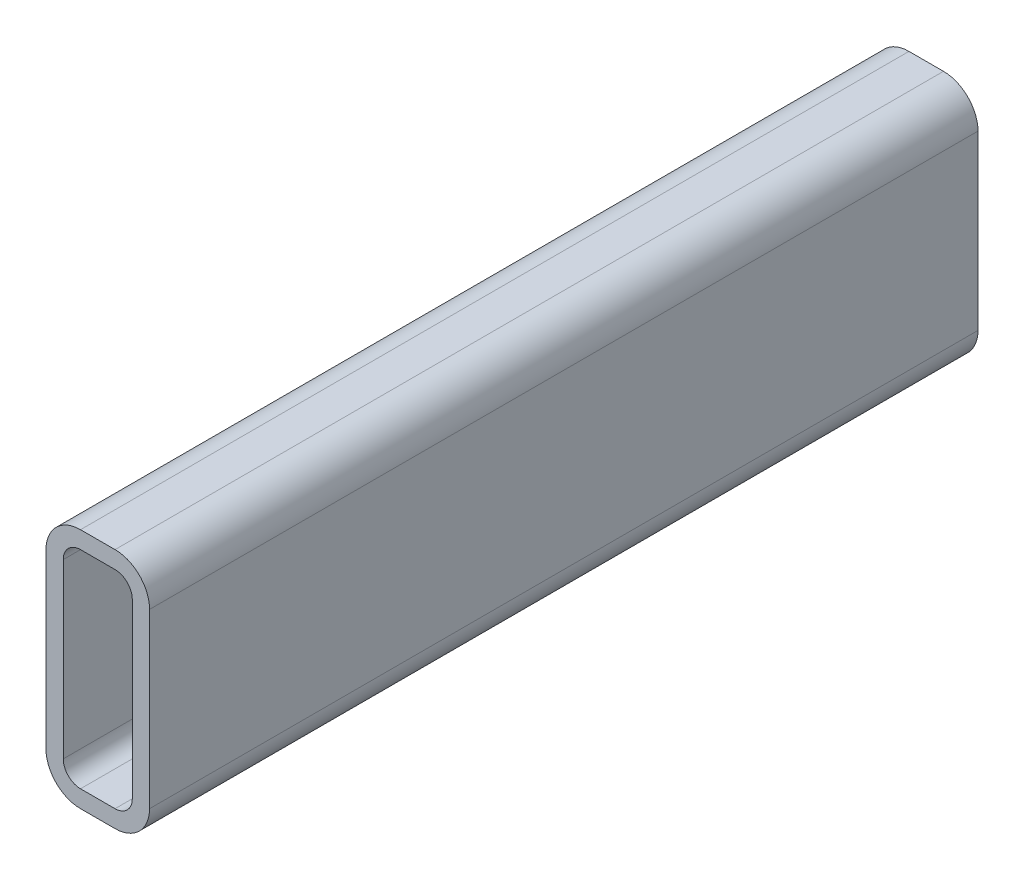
ISO-10303-21;
HEADER;
FILE_DESCRIPTION(('STEP AP214'),'2;1');
FILE_NAME('part.step','',(''),(''),'','','');
FILE_SCHEMA(('AUTOMOTIVE_DESIGN { 1 0 10303 214 1 1 1 1 }'));
ENDSEC;
DATA;
#1=APPLICATION_CONTEXT('core data for automotive mechanical design processes');
#2=APPLICATION_PROTOCOL_DEFINITION('international standard','automotive_design',2000,#1);
#3=PRODUCT_CONTEXT('',#1,'mechanical');
#4=PRODUCT('Part','Part','',(#3));
#5=PRODUCT_RELATED_PRODUCT_CATEGORY('part','',(#4));
#6=PRODUCT_DEFINITION_FORMATION('','',#4);
#7=PRODUCT_DEFINITION_CONTEXT('part definition',#1,'design');
#8=PRODUCT_DEFINITION('design','',#6,#7);
#9=PRODUCT_DEFINITION_SHAPE('','',#8);
#10=(LENGTH_UNIT() NAMED_UNIT(*) SI_UNIT(.MILLI.,.METRE.));
#11=(NAMED_UNIT(*) PLANE_ANGLE_UNIT() SI_UNIT($,.RADIAN.));
#12=(NAMED_UNIT(*) SI_UNIT($,.STERADIAN.) SOLID_ANGLE_UNIT());
#13=UNCERTAINTY_MEASURE_WITH_UNIT(LENGTH_MEASURE(1.E-05),#10,'distance_accuracy_value','');
#14=(GEOMETRIC_REPRESENTATION_CONTEXT(3) GLOBAL_UNCERTAINTY_ASSIGNED_CONTEXT((#13)) GLOBAL_UNIT_ASSIGNED_CONTEXT((#10,
#11,#12)) REPRESENTATION_CONTEXT('',''));
#15=CARTESIAN_POINT('',(0.,0.,0.));
#16=DIRECTION('',(0.,0.,1.));
#17=DIRECTION('',(1.,0.,0.));
#18=AXIS2_PLACEMENT_3D('',#15,#16,#17);
#19=CARTESIAN_POINT('',(12.7,76.2,304.8));
#20=DIRECTION('',(0.,0.,1.));
#21=DIRECTION('',(1.,0.,0.));
#22=AXIS2_PLACEMENT_3D('',#19,#20,#21);
#23=PLANE('',#22);
#24=CARTESIAN_POINT('',(12.7,76.2,304.8));
#25=DIRECTION('',(0.,0.,1.));
#26=DIRECTION('',(1.,0.,0.));
#27=AXIS2_PLACEMENT_3D('',#24,#25,#26);
#28=CIRCLE('',#27,12.7);
#29=CARTESIAN_POINT('',(12.7,88.9,304.8));
#30=VERTEX_POINT('',#29);
#31=CARTESIAN_POINT('',(0.,76.2,304.8));
#32=VERTEX_POINT('',#31);
#33=EDGE_CURVE('E211',#30,#32,#28,.T.);
#34=ORIENTED_EDGE('',*,*,#33,.T.);
#35=DIRECTION('',(0.,-1.,0.));
#36=VECTOR('',#35,1.);
#37=CARTESIAN_POINT('',(0.,12.7,304.8));
#38=LINE('',#37,#36);
#39=CARTESIAN_POINT('',(0.,12.7,304.8));
#40=VERTEX_POINT('',#39);
#41=EDGE_CURVE('E214',#32,#40,#38,.T.);
#42=ORIENTED_EDGE('',*,*,#41,.T.);
#43=CARTESIAN_POINT('',(12.7,12.7,304.8));
#44=DIRECTION('',(0.,0.,1.));
#45=DIRECTION('',(1.,0.,0.));
#46=AXIS2_PLACEMENT_3D('',#43,#44,#45);
#47=CIRCLE('',#46,12.7);
#48=CARTESIAN_POINT('',(12.7,0.,304.8));
#49=VERTEX_POINT('',#48);
#50=EDGE_CURVE('E217',#40,#49,#47,.T.);
#51=ORIENTED_EDGE('',*,*,#50,.T.);
#52=DIRECTION('',(1.,0.,0.));
#53=VECTOR('',#52,1.);
#54=CARTESIAN_POINT('',(25.4,0.,304.8));
#55=LINE('',#54,#53);
#56=CARTESIAN_POINT('',(25.4,0.,304.8));
#57=VERTEX_POINT('',#56);
#58=EDGE_CURVE('E219',#49,#57,#55,.T.);
#59=ORIENTED_EDGE('',*,*,#58,.T.);
#60=CARTESIAN_POINT('',(25.4,12.7,304.8));
#61=DIRECTION('',(0.,0.,1.));
#62=DIRECTION('',(1.,0.,0.));
#63=AXIS2_PLACEMENT_3D('',#60,#61,#62);
#64=CIRCLE('',#63,12.7);
#65=CARTESIAN_POINT('',(38.1,12.7,304.8));
#66=VERTEX_POINT('',#65);
#67=EDGE_CURVE('E221',#57,#66,#64,.T.);
#68=ORIENTED_EDGE('',*,*,#67,.T.);
#69=DIRECTION('',(0.,1.,0.));
#70=VECTOR('',#69,1.);
#71=CARTESIAN_POINT('',(38.1,76.2,304.8));
#72=LINE('',#71,#70);
#73=CARTESIAN_POINT('',(38.1,76.2,304.8));
#74=VERTEX_POINT('',#73);
#75=EDGE_CURVE('E223',#66,#74,#72,.T.);
#76=ORIENTED_EDGE('',*,*,#75,.T.);
#77=CARTESIAN_POINT('',(25.4,76.2,304.8));
#78=DIRECTION('',(0.,0.,1.));
#79=DIRECTION('',(1.,0.,0.));
#80=AXIS2_PLACEMENT_3D('',#77,#78,#79);
#81=CIRCLE('',#80,12.7);
#82=CARTESIAN_POINT('',(25.4,88.9,304.8));
#83=VERTEX_POINT('',#82);
#84=EDGE_CURVE('E225',#74,#83,#81,.T.);
#85=ORIENTED_EDGE('',*,*,#84,.T.);
#86=DIRECTION('',(-1.,0.,0.));
#87=VECTOR('',#86,1.);
#88=CARTESIAN_POINT('',(12.7,88.9,304.8));
#89=LINE('',#88,#87);
#90=EDGE_CURVE('E227',#83,#30,#89,.T.);
#91=ORIENTED_EDGE('',*,*,#90,.T.);
#92=EDGE_LOOP('',(#34,#42,#51,#59,#68,#76,#85,#91));
#93=FACE_BOUND('',#92,.T.);
#94=DIRECTION('',(0.,-1.,0.));
#95=VECTOR('',#94,1.);
#96=CARTESIAN_POINT('',(6.35,12.7,304.8));
#97=LINE('',#96,#95);
#98=CARTESIAN_POINT('',(6.35,76.2,304.8));
#99=VERTEX_POINT('',#98);
#100=CARTESIAN_POINT('',(6.35,12.7,304.8));
#101=VERTEX_POINT('',#100);
#102=EDGE_CURVE('E154',#99,#101,#97,.T.);
#103=ORIENTED_EDGE('',*,*,#102,.F.);
#104=CARTESIAN_POINT('',(12.7,76.2,304.8));
#105=DIRECTION('',(0.,0.,1.));
#106=DIRECTION('',(1.,0.,0.));
#107=AXIS2_PLACEMENT_3D('',#104,#105,#106);
#108=CIRCLE('',#107,6.35);
#109=CARTESIAN_POINT('',(12.7,82.55,304.8));
#110=VERTEX_POINT('',#109);
#111=EDGE_CURVE('E146',#110,#99,#108,.T.);
#112=ORIENTED_EDGE('',*,*,#111,.F.);
#113=DIRECTION('',(-1.,0.,0.));
#114=VECTOR('',#113,1.);
#115=CARTESIAN_POINT('',(12.7,82.55,304.8));
#116=LINE('',#115,#114);
#117=CARTESIAN_POINT('',(25.4,82.55,304.8));
#118=VERTEX_POINT('',#117);
#119=EDGE_CURVE('E179',#118,#110,#116,.T.);
#120=ORIENTED_EDGE('',*,*,#119,.F.);
#121=CARTESIAN_POINT('',(25.4,76.2,304.8));
#122=DIRECTION('',(0.,0.,1.));
#123=DIRECTION('',(1.,0.,0.));
#124=AXIS2_PLACEMENT_3D('',#121,#122,#123);
#125=CIRCLE('',#124,6.35);
#126=CARTESIAN_POINT('',(31.75,76.2,304.8));
#127=VERTEX_POINT('',#126);
#128=EDGE_CURVE('E177',#127,#118,#125,.T.);
#129=ORIENTED_EDGE('',*,*,#128,.F.);
#130=DIRECTION('',(0.,1.,0.));
#131=VECTOR('',#130,1.);
#132=CARTESIAN_POINT('',(31.75,76.2,304.8));
#133=LINE('',#132,#131);
#134=CARTESIAN_POINT('',(31.75,12.7,304.8));
#135=VERTEX_POINT('',#134);
#136=EDGE_CURVE('E175',#135,#127,#133,.T.);
#137=ORIENTED_EDGE('',*,*,#136,.F.);
#138=CARTESIAN_POINT('',(25.4,12.7,304.8));
#139=DIRECTION('',(0.,0.,1.));
#140=DIRECTION('',(1.,0.,0.));
#141=AXIS2_PLACEMENT_3D('',#138,#139,#140);
#142=CIRCLE('',#141,6.35);
#143=CARTESIAN_POINT('',(25.4,6.35000000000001,304.8));
#144=VERTEX_POINT('',#143);
#145=EDGE_CURVE('E173',#144,#135,#142,.T.);
#146=ORIENTED_EDGE('',*,*,#145,.F.);
#147=DIRECTION('',(1.,0.,0.));
#148=VECTOR('',#147,1.);
#149=CARTESIAN_POINT('',(25.4,6.35000000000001,304.8));
#150=LINE('',#149,#148);
#151=CARTESIAN_POINT('',(12.7,6.35000000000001,304.8));
#152=VERTEX_POINT('',#151);
#153=EDGE_CURVE('E169',#152,#144,#150,.T.);
#154=ORIENTED_EDGE('',*,*,#153,.F.);
#155=CARTESIAN_POINT('',(12.7,12.7,304.8));
#156=DIRECTION('',(0.,0.,1.));
#157=DIRECTION('',(1.,0.,0.));
#158=AXIS2_PLACEMENT_3D('',#155,#156,#157);
#159=CIRCLE('',#158,6.35);
#160=EDGE_CURVE('E167',#101,#152,#159,.T.);
#161=ORIENTED_EDGE('',*,*,#160,.F.);
#162=EDGE_LOOP('',(#103,#112,#120,#129,#137,#146,#154,#161));
#163=FACE_BOUND('',#162,.T.);
#164=ADVANCED_FACE('F33',(#93,#163),#23,.T.);
#165=CARTESIAN_POINT('',(12.7,76.2,0.));
#166=DIRECTION('',(0.,0.,1.));
#167=DIRECTION('',(1.,0.,0.));
#168=AXIS2_PLACEMENT_3D('',#165,#166,#167);
#169=PLANE('',#168);
#170=CARTESIAN_POINT('',(12.7,76.2,0.));
#171=DIRECTION('',(0.,0.,1.));
#172=DIRECTION('',(1.,0.,0.));
#173=AXIS2_PLACEMENT_3D('',#170,#171,#172);
#174=CIRCLE('',#173,12.7);
#175=CARTESIAN_POINT('',(12.7,88.9,0.));
#176=VERTEX_POINT('',#175);
#177=CARTESIAN_POINT('',(0.,76.2,0.));
#178=VERTEX_POINT('',#177);
#179=EDGE_CURVE('E162',#176,#178,#174,.T.);
#180=ORIENTED_EDGE('',*,*,#179,.F.);
#181=DIRECTION('',(-1.,0.,0.));
#182=VECTOR('',#181,1.);
#183=CARTESIAN_POINT('',(12.7,88.9,0.));
#184=LINE('',#183,#182);
#185=CARTESIAN_POINT('',(25.4,88.9,0.));
#186=VERTEX_POINT('',#185);
#187=EDGE_CURVE('E215',#186,#176,#184,.T.);
#188=ORIENTED_EDGE('',*,*,#187,.F.);
#189=CARTESIAN_POINT('',(25.4,76.2,0.));
#190=DIRECTION('',(0.,0.,1.));
#191=DIRECTION('',(1.,0.,0.));
#192=AXIS2_PLACEMENT_3D('',#189,#190,#191);
#193=CIRCLE('',#192,12.7);
#194=CARTESIAN_POINT('',(38.1,76.2,0.));
#195=VERTEX_POINT('',#194);
#196=EDGE_CURVE('E242',#195,#186,#193,.T.);
#197=ORIENTED_EDGE('',*,*,#196,.F.);
#198=DIRECTION('',(0.,1.,0.));
#199=VECTOR('',#198,1.);
#200=CARTESIAN_POINT('',(38.1,76.2,0.));
#201=LINE('',#200,#199);
#202=CARTESIAN_POINT('',(38.1,12.7,0.));
#203=VERTEX_POINT('',#202);
#204=EDGE_CURVE('E240',#203,#195,#201,.T.);
#205=ORIENTED_EDGE('',*,*,#204,.F.);
#206=CARTESIAN_POINT('',(25.4,12.7,0.));
#207=DIRECTION('',(0.,0.,1.));
#208=DIRECTION('',(1.,0.,0.));
#209=AXIS2_PLACEMENT_3D('',#206,#207,#208);
#210=CIRCLE('',#209,12.7);
#211=CARTESIAN_POINT('',(25.4,0.,0.));
#212=VERTEX_POINT('',#211);
#213=EDGE_CURVE('E238',#212,#203,#210,.T.);
#214=ORIENTED_EDGE('',*,*,#213,.F.);
#215=DIRECTION('',(1.,0.,0.));
#216=VECTOR('',#215,1.);
#217=CARTESIAN_POINT('',(25.4,0.,0.));
#218=LINE('',#217,#216);
#219=CARTESIAN_POINT('',(12.7,0.,0.));
#220=VERTEX_POINT('',#219);
#221=EDGE_CURVE('E236',#220,#212,#218,.T.);
#222=ORIENTED_EDGE('',*,*,#221,.F.);
#223=CARTESIAN_POINT('',(12.7,12.7,0.));
#224=DIRECTION('',(0.,0.,1.));
#225=DIRECTION('',(1.,0.,0.));
#226=AXIS2_PLACEMENT_3D('',#223,#224,#225);
#227=CIRCLE('',#226,12.7);
#228=CARTESIAN_POINT('',(0.,12.7,0.));
#229=VERTEX_POINT('',#228);
#230=EDGE_CURVE('E234',#229,#220,#227,.T.);
#231=ORIENTED_EDGE('',*,*,#230,.F.);
#232=DIRECTION('',(0.,-1.,0.));
#233=VECTOR('',#232,1.);
#234=CARTESIAN_POINT('',(0.,12.7,0.));
#235=LINE('',#234,#233);
#236=EDGE_CURVE('E232',#178,#229,#235,.T.);
#237=ORIENTED_EDGE('',*,*,#236,.F.);
#238=EDGE_LOOP('',(#180,#188,#197,#205,#214,#222,#231,#237));
#239=FACE_BOUND('',#238,.T.);
#240=CARTESIAN_POINT('',(12.7,76.2,0.));
#241=DIRECTION('',(0.,0.,1.));
#242=DIRECTION('',(1.,0.,0.));
#243=AXIS2_PLACEMENT_3D('',#240,#241,#242);
#244=CIRCLE('',#243,6.35);
#245=CARTESIAN_POINT('',(12.7,82.55,0.));
#246=VERTEX_POINT('',#245);
#247=CARTESIAN_POINT('',(6.35,76.2,0.));
#248=VERTEX_POINT('',#247);
#249=EDGE_CURVE('E56',#246,#248,#244,.T.);
#250=ORIENTED_EDGE('',*,*,#249,.T.);
#251=DIRECTION('',(0.,-1.,0.));
#252=VECTOR('',#251,1.);
#253=CARTESIAN_POINT('',(6.35,12.7,0.));
#254=LINE('',#253,#252);
#255=CARTESIAN_POINT('',(6.35,12.7,0.));
#256=VERTEX_POINT('',#255);
#257=EDGE_CURVE('E161',#248,#256,#254,.T.);
#258=ORIENTED_EDGE('',*,*,#257,.T.);
#259=CARTESIAN_POINT('',(12.7,12.7,0.));
#260=DIRECTION('',(0.,0.,1.));
#261=DIRECTION('',(1.,0.,0.));
#262=AXIS2_PLACEMENT_3D('',#259,#260,#261);
#263=CIRCLE('',#262,6.35);
#264=CARTESIAN_POINT('',(12.7,6.35000000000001,0.));
#265=VERTEX_POINT('',#264);
#266=EDGE_CURVE('E183',#256,#265,#263,.T.);
#267=ORIENTED_EDGE('',*,*,#266,.T.);
#268=DIRECTION('',(1.,0.,0.));
#269=VECTOR('',#268,1.);
#270=CARTESIAN_POINT('',(25.4,6.35000000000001,0.));
#271=LINE('',#270,#269);
#272=CARTESIAN_POINT('',(25.4,6.35000000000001,0.));
#273=VERTEX_POINT('',#272);
#274=EDGE_CURVE('E186',#265,#273,#271,.T.);
#275=ORIENTED_EDGE('',*,*,#274,.T.);
#276=CARTESIAN_POINT('',(25.4,12.7,0.));
#277=DIRECTION('',(0.,0.,1.));
#278=DIRECTION('',(1.,0.,0.));
#279=AXIS2_PLACEMENT_3D('',#276,#277,#278);
#280=CIRCLE('',#279,6.35);
#281=CARTESIAN_POINT('',(31.75,12.7,0.));
#282=VERTEX_POINT('',#281);
#283=EDGE_CURVE('E189',#273,#282,#280,.T.);
#284=ORIENTED_EDGE('',*,*,#283,.T.);
#285=DIRECTION('',(0.,1.,0.));
#286=VECTOR('',#285,1.);
#287=CARTESIAN_POINT('',(31.75,76.2,0.));
#288=LINE('',#287,#286);
#289=CARTESIAN_POINT('',(31.75,76.2,0.));
#290=VERTEX_POINT('',#289);
#291=EDGE_CURVE('E192',#282,#290,#288,.T.);
#292=ORIENTED_EDGE('',*,*,#291,.T.);
#293=CARTESIAN_POINT('',(25.4,76.2,0.));
#294=DIRECTION('',(0.,0.,1.));
#295=DIRECTION('',(1.,0.,0.));
#296=AXIS2_PLACEMENT_3D('',#293,#294,#295);
#297=CIRCLE('',#296,6.35);
#298=CARTESIAN_POINT('',(25.4,82.55,0.));
#299=VERTEX_POINT('',#298);
#300=EDGE_CURVE('E195',#290,#299,#297,.T.);
#301=ORIENTED_EDGE('',*,*,#300,.T.);
#302=DIRECTION('',(-1.,0.,0.));
#303=VECTOR('',#302,1.);
#304=CARTESIAN_POINT('',(12.7,82.55,0.));
#305=LINE('',#304,#303);
#306=EDGE_CURVE('E155',#299,#246,#305,.T.);
#307=ORIENTED_EDGE('',*,*,#306,.T.);
#308=EDGE_LOOP('',(#250,#258,#267,#275,#284,#292,#301,#307));
#309=FACE_BOUND('',#308,.T.);
#310=ADVANCED_FACE('F272',(#239,#309),#169,.F.);
#311=CARTESIAN_POINT('',(12.7,76.2,304.8));
#312=DIRECTION('',(0.,0.,-1.));
#313=DIRECTION('',(-1.,0.,0.));
#314=AXIS2_PLACEMENT_3D('',#311,#312,#313);
#315=CYLINDRICAL_SURFACE('',#314,12.7);
#316=ORIENTED_EDGE('',*,*,#179,.T.);
#317=DIRECTION('',(0.,0.,-1.));
#318=VECTOR('',#317,1.);
#319=CARTESIAN_POINT('',(0.,76.2,304.8));
#320=LINE('',#319,#318);
#321=EDGE_CURVE('E11',#32,#178,#320,.T.);
#322=ORIENTED_EDGE('',*,*,#321,.F.);
#323=ORIENTED_EDGE('',*,*,#33,.F.);
#324=DIRECTION('',(0.,0.,-1.));
#325=VECTOR('',#324,1.);
#326=CARTESIAN_POINT('',(12.7,88.9,304.8));
#327=LINE('',#326,#325);
#328=EDGE_CURVE('E229',#30,#176,#327,.T.);
#329=ORIENTED_EDGE('',*,*,#328,.T.);
#330=EDGE_LOOP('',(#316,#322,#323,#329));
#331=FACE_BOUND('',#330,.T.);
#332=ADVANCED_FACE('F35',(#331),#315,.T.);
#333=CARTESIAN_POINT('',(0.,12.7,304.8));
#334=DIRECTION('',(1.,0.,0.));
#335=DIRECTION('',(0.,0.,-1.));
#336=AXIS2_PLACEMENT_3D('',#333,#334,#335);
#337=PLANE('',#336);
#338=ORIENTED_EDGE('',*,*,#236,.T.);
#339=DIRECTION('',(0.,0.,-1.));
#340=VECTOR('',#339,1.);
#341=CARTESIAN_POINT('',(0.,12.7,304.8));
#342=LINE('',#341,#340);
#343=EDGE_CURVE('E41',#40,#229,#342,.T.);
#344=ORIENTED_EDGE('',*,*,#343,.F.);
#345=ORIENTED_EDGE('',*,*,#41,.F.);
#346=ORIENTED_EDGE('',*,*,#321,.T.);
#347=EDGE_LOOP('',(#338,#344,#345,#346));
#348=FACE_BOUND('',#347,.T.);
#349=ADVANCED_FACE('F289',(#348),#337,.F.);
#350=CARTESIAN_POINT('',(12.7,12.7,304.8));
#351=DIRECTION('',(0.,0.,-1.));
#352=DIRECTION('',(-1.,0.,0.));
#353=AXIS2_PLACEMENT_3D('',#350,#351,#352);
#354=CYLINDRICAL_SURFACE('',#353,12.7);
#355=ORIENTED_EDGE('',*,*,#230,.T.);
#356=DIRECTION('',(0.,0.,-1.));
#357=VECTOR('',#356,1.);
#358=CARTESIAN_POINT('',(12.7,0.,304.8));
#359=LINE('',#358,#357);
#360=EDGE_CURVE('E259',#49,#220,#359,.T.);
#361=ORIENTED_EDGE('',*,*,#360,.F.);
#362=ORIENTED_EDGE('',*,*,#50,.F.);
#363=ORIENTED_EDGE('',*,*,#343,.T.);
#364=EDGE_LOOP('',(#355,#361,#362,#363));
#365=FACE_BOUND('',#364,.T.);
#366=ADVANCED_FACE('F266',(#365),#354,.T.);
#367=CARTESIAN_POINT('',(25.4,0.,304.8));
#368=DIRECTION('',(0.,1.,0.));
#369=DIRECTION('',(0.,0.,1.));
#370=AXIS2_PLACEMENT_3D('',#367,#368,#369);
#371=PLANE('',#370);
#372=ORIENTED_EDGE('',*,*,#221,.T.);
#373=DIRECTION('',(0.,0.,-1.));
#374=VECTOR('',#373,1.);
#375=CARTESIAN_POINT('',(25.4,0.,304.8));
#376=LINE('',#375,#374);
#377=EDGE_CURVE('E256',#57,#212,#376,.T.);
#378=ORIENTED_EDGE('',*,*,#377,.F.);
#379=ORIENTED_EDGE('',*,*,#58,.F.);
#380=ORIENTED_EDGE('',*,*,#360,.T.);
#381=EDGE_LOOP('',(#372,#378,#379,#380));
#382=FACE_BOUND('',#381,.T.);
#383=ADVANCED_FACE('F278',(#382),#371,.F.);
#384=CARTESIAN_POINT('',(25.4,12.7,304.8));
#385=DIRECTION('',(0.,0.,-1.));
#386=DIRECTION('',(-1.,0.,0.));
#387=AXIS2_PLACEMENT_3D('',#384,#385,#386);
#388=CYLINDRICAL_SURFACE('',#387,12.7);
#389=ORIENTED_EDGE('',*,*,#213,.T.);
#390=DIRECTION('',(0.,0.,-1.));
#391=VECTOR('',#390,1.);
#392=CARTESIAN_POINT('',(38.1,12.7,304.8));
#393=LINE('',#392,#391);
#394=EDGE_CURVE('E253',#66,#203,#393,.T.);
#395=ORIENTED_EDGE('',*,*,#394,.F.);
#396=ORIENTED_EDGE('',*,*,#67,.F.);
#397=ORIENTED_EDGE('',*,*,#377,.T.);
#398=EDGE_LOOP('',(#389,#395,#396,#397));
#399=FACE_BOUND('',#398,.T.);
#400=ADVANCED_FACE('F282',(#399),#388,.T.);
#401=CARTESIAN_POINT('',(38.1,76.2,304.8));
#402=DIRECTION('',(-1.,0.,0.));
#403=DIRECTION('',(0.,0.,1.));
#404=AXIS2_PLACEMENT_3D('',#401,#402,#403);
#405=PLANE('',#404);
#406=ORIENTED_EDGE('',*,*,#204,.T.);
#407=DIRECTION('',(0.,0.,-1.));
#408=VECTOR('',#407,1.);
#409=CARTESIAN_POINT('',(38.1,76.2,304.8));
#410=LINE('',#409,#408);
#411=EDGE_CURVE('E250',#74,#195,#410,.T.);
#412=ORIENTED_EDGE('',*,*,#411,.F.);
#413=ORIENTED_EDGE('',*,*,#75,.F.);
#414=ORIENTED_EDGE('',*,*,#394,.T.);
#415=EDGE_LOOP('',(#406,#412,#413,#414));
#416=FACE_BOUND('',#415,.T.);
#417=ADVANCED_FACE('F302',(#416),#405,.F.);
#418=CARTESIAN_POINT('',(25.4,76.2,304.8));
#419=DIRECTION('',(0.,0.,-1.));
#420=DIRECTION('',(-1.,0.,0.));
#421=AXIS2_PLACEMENT_3D('',#418,#419,#420);
#422=CYLINDRICAL_SURFACE('',#421,12.7);
#423=ORIENTED_EDGE('',*,*,#196,.T.);
#424=DIRECTION('',(0.,0.,-1.));
#425=VECTOR('',#424,1.);
#426=CARTESIAN_POINT('',(25.4,88.9,304.8));
#427=LINE('',#426,#425);
#428=EDGE_CURVE('E247',#83,#186,#427,.T.);
#429=ORIENTED_EDGE('',*,*,#428,.F.);
#430=ORIENTED_EDGE('',*,*,#84,.F.);
#431=ORIENTED_EDGE('',*,*,#411,.T.);
#432=EDGE_LOOP('',(#423,#429,#430,#431));
#433=FACE_BOUND('',#432,.T.);
#434=ADVANCED_FACE('F300',(#433),#422,.T.);
#435=CARTESIAN_POINT('',(12.7,88.9,304.8));
#436=DIRECTION('',(0.,-1.,0.));
#437=DIRECTION('',(0.,0.,-1.));
#438=AXIS2_PLACEMENT_3D('',#435,#436,#437);
#439=PLANE('',#438);
#440=ORIENTED_EDGE('',*,*,#187,.T.);
#441=ORIENTED_EDGE('',*,*,#328,.F.);
#442=ORIENTED_EDGE('',*,*,#90,.F.);
#443=ORIENTED_EDGE('',*,*,#428,.T.);
#444=EDGE_LOOP('',(#440,#441,#442,#443));
#445=FACE_BOUND('',#444,.T.);
#446=ADVANCED_FACE('F295',(#445),#439,.F.);
#447=CARTESIAN_POINT('',(12.7,76.2,304.8));
#448=DIRECTION('',(0.,0.,-1.));
#449=DIRECTION('',(-1.,0.,0.));
#450=AXIS2_PLACEMENT_3D('',#447,#448,#449);
#451=CYLINDRICAL_SURFACE('',#450,6.35);
#452=ORIENTED_EDGE('',*,*,#249,.F.);
#453=DIRECTION('',(0.,0.,-1.));
#454=VECTOR('',#453,1.);
#455=CARTESIAN_POINT('',(12.7,82.55,304.8));
#456=LINE('',#455,#454);
#457=EDGE_CURVE('E150',#110,#246,#456,.T.);
#458=ORIENTED_EDGE('',*,*,#457,.F.);
#459=ORIENTED_EDGE('',*,*,#111,.T.);
#460=DIRECTION('',(0.,0.,-1.));
#461=VECTOR('',#460,1.);
#462=CARTESIAN_POINT('',(6.35,76.2,304.8));
#463=LINE('',#462,#461);
#464=EDGE_CURVE('E149',#99,#248,#463,.T.);
#465=ORIENTED_EDGE('',*,*,#464,.T.);
#466=EDGE_LOOP('',(#452,#458,#459,#465));
#467=FACE_BOUND('',#466,.T.);
#468=ADVANCED_FACE('F148',(#467),#451,.F.);
#469=CARTESIAN_POINT('',(6.35,12.7,304.8));
#470=DIRECTION('',(1.,0.,0.));
#471=DIRECTION('',(0.,0.,-1.));
#472=AXIS2_PLACEMENT_3D('',#469,#470,#471);
#473=PLANE('',#472);
#474=ORIENTED_EDGE('',*,*,#257,.F.);
#475=ORIENTED_EDGE('',*,*,#464,.F.);
#476=ORIENTED_EDGE('',*,*,#102,.T.);
#477=DIRECTION('',(0.,0.,-1.));
#478=VECTOR('',#477,1.);
#479=CARTESIAN_POINT('',(6.35,12.7,304.8));
#480=LINE('',#479,#478);
#481=EDGE_CURVE('E163',#101,#256,#480,.T.);
#482=ORIENTED_EDGE('',*,*,#481,.T.);
#483=EDGE_LOOP('',(#474,#475,#476,#482));
#484=FACE_BOUND('',#483,.T.);
#485=ADVANCED_FACE('F158',(#484),#473,.T.);
#486=CARTESIAN_POINT('',(12.7,12.7,304.8));
#487=DIRECTION('',(0.,0.,-1.));
#488=DIRECTION('',(-1.,0.,0.));
#489=AXIS2_PLACEMENT_3D('',#486,#487,#488);
#490=CYLINDRICAL_SURFACE('',#489,6.35);
#491=ORIENTED_EDGE('',*,*,#266,.F.);
#492=ORIENTED_EDGE('',*,*,#481,.F.);
#493=ORIENTED_EDGE('',*,*,#160,.T.);
#494=DIRECTION('',(0.,0.,-1.));
#495=VECTOR('',#494,1.);
#496=CARTESIAN_POINT('',(12.7,6.35000000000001,304.8));
#497=LINE('',#496,#495);
#498=EDGE_CURVE('E208',#152,#265,#497,.T.);
#499=ORIENTED_EDGE('',*,*,#498,.T.);
#500=EDGE_LOOP('',(#491,#492,#493,#499));
#501=FACE_BOUND('',#500,.T.);
#502=ADVANCED_FACE('F327',(#501),#490,.F.);
#503=CARTESIAN_POINT('',(25.4,6.35000000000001,304.8));
#504=DIRECTION('',(0.,1.,0.));
#505=DIRECTION('',(0.,0.,1.));
#506=AXIS2_PLACEMENT_3D('',#503,#504,#505);
#507=PLANE('',#506);
#508=ORIENTED_EDGE('',*,*,#274,.F.);
#509=ORIENTED_EDGE('',*,*,#498,.F.);
#510=ORIENTED_EDGE('',*,*,#153,.T.);
#511=DIRECTION('',(0.,0.,-1.));
#512=VECTOR('',#511,1.);
#513=CARTESIAN_POINT('',(25.4,6.35000000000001,304.8));
#514=LINE('',#513,#512);
#515=EDGE_CURVE('E206',#144,#273,#514,.T.);
#516=ORIENTED_EDGE('',*,*,#515,.T.);
#517=EDGE_LOOP('',(#508,#509,#510,#516));
#518=FACE_BOUND('',#517,.T.);
#519=ADVANCED_FACE('F331',(#518),#507,.T.);
#520=CARTESIAN_POINT('',(25.4,12.7,304.8));
#521=DIRECTION('',(0.,0.,-1.));
#522=DIRECTION('',(-1.,0.,0.));
#523=AXIS2_PLACEMENT_3D('',#520,#521,#522);
#524=CYLINDRICAL_SURFACE('',#523,6.35);
#525=ORIENTED_EDGE('',*,*,#283,.F.);
#526=ORIENTED_EDGE('',*,*,#515,.F.);
#527=ORIENTED_EDGE('',*,*,#145,.T.);
#528=DIRECTION('',(0.,0.,-1.));
#529=VECTOR('',#528,1.);
#530=CARTESIAN_POINT('',(31.75,12.7,304.8));
#531=LINE('',#530,#529);
#532=EDGE_CURVE('E204',#135,#282,#531,.T.);
#533=ORIENTED_EDGE('',*,*,#532,.T.);
#534=EDGE_LOOP('',(#525,#526,#527,#533));
#535=FACE_BOUND('',#534,.T.);
#536=ADVANCED_FACE('F337',(#535),#524,.F.);
#537=CARTESIAN_POINT('',(31.75,76.2,304.8));
#538=DIRECTION('',(-1.,0.,0.));
#539=DIRECTION('',(0.,0.,1.));
#540=AXIS2_PLACEMENT_3D('',#537,#538,#539);
#541=PLANE('',#540);
#542=ORIENTED_EDGE('',*,*,#291,.F.);
#543=ORIENTED_EDGE('',*,*,#532,.F.);
#544=ORIENTED_EDGE('',*,*,#136,.T.);
#545=DIRECTION('',(0.,0.,-1.));
#546=VECTOR('',#545,1.);
#547=CARTESIAN_POINT('',(31.75,76.2,304.8));
#548=LINE('',#547,#546);
#549=EDGE_CURVE('E202',#127,#290,#548,.T.);
#550=ORIENTED_EDGE('',*,*,#549,.T.);
#551=EDGE_LOOP('',(#542,#543,#544,#550));
#552=FACE_BOUND('',#551,.T.);
#553=ADVANCED_FACE('F341',(#552),#541,.T.);
#554=CARTESIAN_POINT('',(25.4,76.2,304.8));
#555=DIRECTION('',(0.,0.,-1.));
#556=DIRECTION('',(-1.,0.,0.));
#557=AXIS2_PLACEMENT_3D('',#554,#555,#556);
#558=CYLINDRICAL_SURFACE('',#557,6.35);
#559=ORIENTED_EDGE('',*,*,#300,.F.);
#560=ORIENTED_EDGE('',*,*,#549,.F.);
#561=ORIENTED_EDGE('',*,*,#128,.T.);
#562=DIRECTION('',(0.,0.,-1.));
#563=VECTOR('',#562,1.);
#564=CARTESIAN_POINT('',(25.4,82.55,304.8));
#565=LINE('',#564,#563);
#566=EDGE_CURVE('E48',#118,#299,#565,.T.);
#567=ORIENTED_EDGE('',*,*,#566,.T.);
#568=EDGE_LOOP('',(#559,#560,#561,#567));
#569=FACE_BOUND('',#568,.T.);
#570=ADVANCED_FACE('F345',(#569),#558,.F.);
#571=CARTESIAN_POINT('',(12.7,82.55,304.8));
#572=DIRECTION('',(0.,-1.,0.));
#573=DIRECTION('',(0.,0.,-1.));
#574=AXIS2_PLACEMENT_3D('',#571,#572,#573);
#575=PLANE('',#574);
#576=ORIENTED_EDGE('',*,*,#306,.F.);
#577=ORIENTED_EDGE('',*,*,#566,.F.);
#578=ORIENTED_EDGE('',*,*,#119,.T.);
#579=ORIENTED_EDGE('',*,*,#457,.T.);
#580=EDGE_LOOP('',(#576,#577,#578,#579));
#581=FACE_BOUND('',#580,.T.);
#582=ADVANCED_FACE('F349',(#581),#575,.T.);
#583=CLOSED_SHELL('',(#164,#310,#332,#349,#366,#383,#400,#417,#434,#446,#468,#485,#502,#519,
#536,#553,#570,#582));
#584=MANIFOLD_SOLID_BREP('B2',#583);
#585=ADVANCED_BREP_SHAPE_REPRESENTATION('',(#18,#584),#14);
#586=SHAPE_DEFINITION_REPRESENTATION(#9,#585);
ENDSEC;
END-ISO-10303-21;
